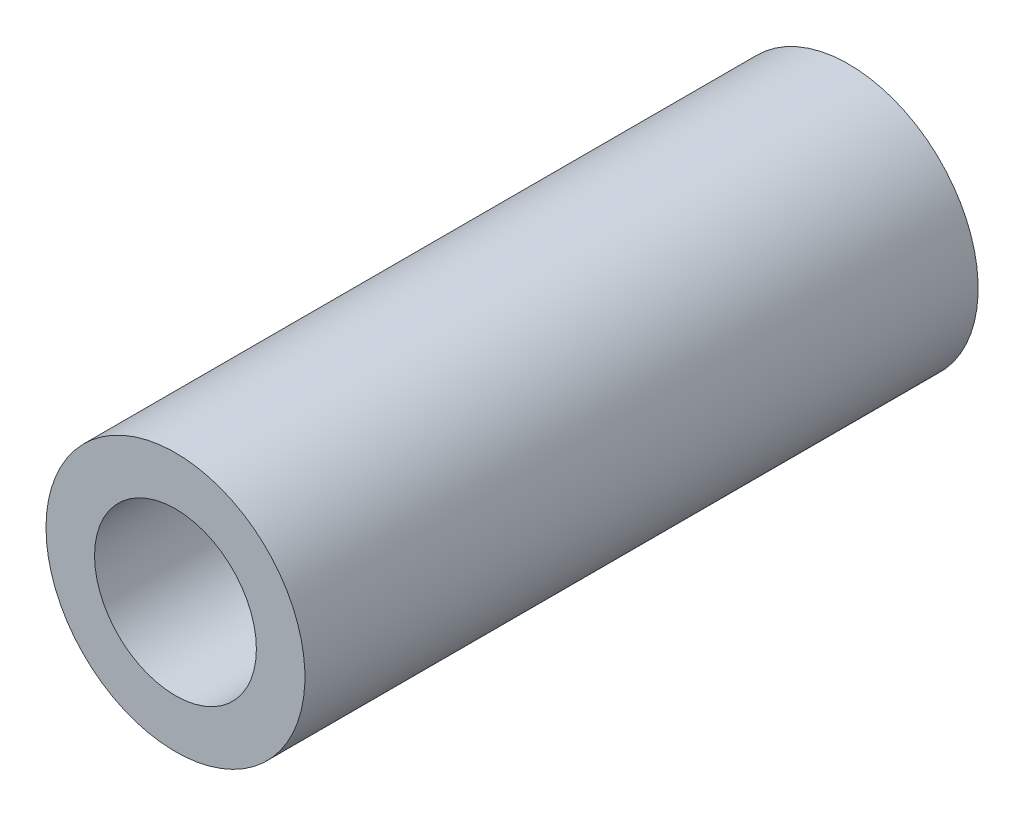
from build123d import *

# Parameters (mm, degrees)
SKETCH1_R          = 2.54
SKETCH1_R_2        = 1.5875
BASE_EXTRUDE_DEPTH = 13.208


with BuildPart() as part:
    # Sketch1 → Base-Extrude (new body)
    with BuildSketch(Plane.XY):
        with Locations(Location((0, 0, 0), (0, 0, 180))):
            Circle(SKETCH1_R)
        with Locations(Location((0, 0, 0), (0, 0, 180))):
            Circle(SKETCH1_R_2, mode=Mode.SUBTRACT)
    extrude(amount=BASE_EXTRUDE_DEPTH)


solid = part.part
